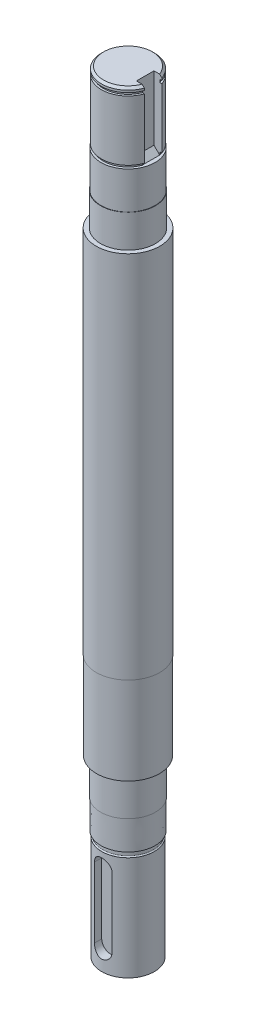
ISO-10303-21;
HEADER;
FILE_DESCRIPTION(('STEP AP214'),'2;1');
FILE_NAME('part.step','',(''),(''),'','','');
FILE_SCHEMA(('AUTOMOTIVE_DESIGN { 1 0 10303 214 1 1 1 1 }'));
ENDSEC;
DATA;
#1=APPLICATION_CONTEXT('core data for automotive mechanical design processes');
#2=APPLICATION_PROTOCOL_DEFINITION('international standard','automotive_design',2000,#1);
#3=PRODUCT_CONTEXT('',#1,'mechanical');
#4=PRODUCT('Part','Part','',(#3));
#5=PRODUCT_RELATED_PRODUCT_CATEGORY('part','',(#4));
#6=PRODUCT_DEFINITION_FORMATION('','',#4);
#7=PRODUCT_DEFINITION_CONTEXT('part definition',#1,'design');
#8=PRODUCT_DEFINITION('design','',#6,#7);
#9=PRODUCT_DEFINITION_SHAPE('','',#8);
#10=(LENGTH_UNIT() NAMED_UNIT(*) SI_UNIT(.MILLI.,.METRE.));
#11=(NAMED_UNIT(*) PLANE_ANGLE_UNIT() SI_UNIT($,.RADIAN.));
#12=(NAMED_UNIT(*) SI_UNIT($,.STERADIAN.) SOLID_ANGLE_UNIT());
#13=UNCERTAINTY_MEASURE_WITH_UNIT(LENGTH_MEASURE(1.E-05),#10,'distance_accuracy_value','');
#14=(GEOMETRIC_REPRESENTATION_CONTEXT(3) GLOBAL_UNCERTAINTY_ASSIGNED_CONTEXT((#13)) GLOBAL_UNIT_ASSIGNED_CONTEXT((#10,
#11,#12)) REPRESENTATION_CONTEXT('',''));
#15=CARTESIAN_POINT('',(0.,0.,0.));
#16=DIRECTION('',(0.,0.,1.));
#17=DIRECTION('',(1.,0.,0.));
#18=AXIS2_PLACEMENT_3D('',#15,#16,#17);
#19=CARTESIAN_POINT('',(12.,50.,0.));
#20=DIRECTION('',(0.,-1.,0.));
#21=DIRECTION('',(0.,0.,-1.));
#22=AXIS2_PLACEMENT_3D('',#19,#20,#21);
#23=PLANE('',#22);
#24=CARTESIAN_POINT('',(0.,50.,0.));
#25=DIRECTION('',(0.,-1.,0.));
#26=DIRECTION('',(0.,0.,-1.));
#27=AXIS2_PLACEMENT_3D('',#24,#25,#26);
#28=CIRCLE('',#27,12.35);
#29=CARTESIAN_POINT('',(0.,50.,-12.35));
#30=VERTEX_POINT('',#29);
#31=EDGE_CURVE('E295',#30,#30,#28,.T.);
#32=ORIENTED_EDGE('',*,*,#31,.T.);
#33=EDGE_LOOP('',(#32));
#34=FACE_BOUND('',#33,.T.);
#35=CARTESIAN_POINT('',(0.,50.,0.));
#36=DIRECTION('',(0.,-1.,0.));
#37=DIRECTION('',(0.,0.,-1.));
#38=AXIS2_PLACEMENT_3D('',#35,#36,#37);
#39=CIRCLE('',#38,11.99);
#40=CARTESIAN_POINT('',(0.,50.,-11.99));
#41=VERTEX_POINT('',#40);
#42=EDGE_CURVE('E219',#41,#41,#39,.T.);
#43=ORIENTED_EDGE('',*,*,#42,.F.);
#44=EDGE_LOOP('',(#43));
#45=FACE_BOUND('',#44,.T.);
#46=ADVANCED_FACE('F33',(#34,#45),#23,.T.);
#47=CARTESIAN_POINT('',(0.,50.,0.));
#48=DIRECTION('',(0.,-1.,0.));
#49=DIRECTION('',(0.,0.,-1.));
#50=AXIS2_PLACEMENT_3D('',#47,#48,#49);
#51=CONICAL_SURFACE('',#50,12.35,0.000548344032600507);
#52=CARTESIAN_POINT('',(0.,63.3,0.));
#53=DIRECTION('',(0.,-1.,0.));
#54=DIRECTION('',(0.,0.,-1.));
#55=AXIS2_PLACEMENT_3D('',#52,#53,#54);
#56=CIRCLE('',#55,12.3427070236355);
#57=CARTESIAN_POINT('',(0.,63.3,-12.3427070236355));
#58=VERTEX_POINT('',#57);
#59=EDGE_CURVE('E292',#58,#58,#56,.T.);
#60=ORIENTED_EDGE('',*,*,#59,.T.);
#61=EDGE_LOOP('',(#60));
#62=FACE_BOUND('',#61,.T.);
#63=ORIENTED_EDGE('',*,*,#31,.F.);
#64=EDGE_LOOP('',(#63));
#65=FACE_BOUND('',#64,.T.);
#66=ADVANCED_FACE('F376',(#62,#65),#51,.T.);
#67=CARTESIAN_POINT('',(12.5,63.3,0.));
#68=DIRECTION('',(0.,-1.,0.));
#69=DIRECTION('',(0.,0.,-1.));
#70=AXIS2_PLACEMENT_3D('',#67,#68,#69);
#71=PLANE('',#70);
#72=CARTESIAN_POINT('',(0.,63.3,0.));
#73=DIRECTION('',(0.,-1.,0.));
#74=DIRECTION('',(0.,0.,-1.));
#75=AXIS2_PLACEMENT_3D('',#72,#73,#74);
#76=CIRCLE('',#75,12.5);
#77=CARTESIAN_POINT('',(0.,63.3,-12.5));
#78=VERTEX_POINT('',#77);
#79=EDGE_CURVE('E289',#78,#78,#76,.T.);
#80=ORIENTED_EDGE('',*,*,#79,.T.);
#81=EDGE_LOOP('',(#80));
#82=FACE_BOUND('',#81,.T.);
#83=ORIENTED_EDGE('',*,*,#59,.F.);
#84=EDGE_LOOP('',(#83));
#85=FACE_BOUND('',#84,.T.);
#86=ADVANCED_FACE('F381',(#82,#85),#71,.T.);
#87=CARTESIAN_POINT('',(0.,326.056951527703,0.));
#88=DIRECTION('',(0.,-1.,0.));
#89=DIRECTION('',(0.,0.,-1.));
#90=AXIS2_PLACEMENT_3D('',#87,#88,#89);
#91=CYLINDRICAL_SURFACE('',#90,12.5);
#92=CARTESIAN_POINT('',(0.,79.5,0.));
#93=DIRECTION('',(0.,-1.,0.));
#94=DIRECTION('',(0.,0.,-1.));
#95=AXIS2_PLACEMENT_3D('',#92,#93,#94);
#96=CIRCLE('',#95,12.5);
#97=CARTESIAN_POINT('',(0.,79.5,-12.5));
#98=VERTEX_POINT('',#97);
#99=EDGE_CURVE('E286',#98,#98,#96,.T.);
#100=ORIENTED_EDGE('',*,*,#99,.T.);
#101=EDGE_LOOP('',(#100));
#102=FACE_BOUND('',#101,.T.);
#103=ORIENTED_EDGE('',*,*,#79,.F.);
#104=EDGE_LOOP('',(#103));
#105=FACE_BOUND('',#104,.T.);
#106=ADVANCED_FACE('F388',(#102,#105),#91,.T.);
#107=CARTESIAN_POINT('',(12.5,79.5,0.));
#108=DIRECTION('',(0.,-1.,0.));
#109=DIRECTION('',(0.,0.,-1.));
#110=AXIS2_PLACEMENT_3D('',#107,#108,#109);
#111=PLANE('',#110);
#112=CARTESIAN_POINT('',(0.,79.5,0.));
#113=DIRECTION('',(0.,-1.,0.));
#114=DIRECTION('',(0.,0.,-1.));
#115=AXIS2_PLACEMENT_3D('',#112,#113,#114);
#116=CIRCLE('',#115,14.4);
#117=CARTESIAN_POINT('',(0.,79.5,-14.4));
#118=VERTEX_POINT('',#117);
#119=EDGE_CURVE('E283',#118,#118,#116,.T.);
#120=ORIENTED_EDGE('',*,*,#119,.T.);
#121=EDGE_LOOP('',(#120));
#122=FACE_BOUND('',#121,.T.);
#123=ORIENTED_EDGE('',*,*,#99,.F.);
#124=EDGE_LOOP('',(#123));
#125=FACE_BOUND('',#124,.T.);
#126=ADVANCED_FACE('F392',(#122,#125),#111,.T.);
#127=CARTESIAN_POINT('',(0.,326.056951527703,0.));
#128=DIRECTION('',(0.,-1.,0.));
#129=DIRECTION('',(0.,0.,-1.));
#130=AXIS2_PLACEMENT_3D('',#127,#128,#129);
#131=CYLINDRICAL_SURFACE('',#130,14.4);
#132=CARTESIAN_POINT('',(0.,119.5,0.));
#133=DIRECTION('',(0.,-1.,0.));
#134=DIRECTION('',(0.,0.,-1.));
#135=AXIS2_PLACEMENT_3D('',#132,#133,#134);
#136=CIRCLE('',#135,14.4);
#137=CARTESIAN_POINT('',(0.,119.5,-14.4));
#138=VERTEX_POINT('',#137);
#139=EDGE_CURVE('E280',#138,#138,#136,.T.);
#140=ORIENTED_EDGE('',*,*,#139,.T.);
#141=EDGE_LOOP('',(#140));
#142=FACE_BOUND('',#141,.T.);
#143=ORIENTED_EDGE('',*,*,#119,.F.);
#144=EDGE_LOOP('',(#143));
#145=FACE_BOUND('',#144,.T.);
#146=ADVANCED_FACE('F396',(#142,#145),#131,.T.);
#147=CARTESIAN_POINT('',(14.5,119.5,0.));
#148=DIRECTION('',(0.,-1.,0.));
#149=DIRECTION('',(0.,0.,-1.));
#150=AXIS2_PLACEMENT_3D('',#147,#148,#149);
#151=PLANE('',#150);
#152=CARTESIAN_POINT('',(0.,119.5,0.));
#153=DIRECTION('',(0.,-1.,0.));
#154=DIRECTION('',(0.,0.,-1.));
#155=AXIS2_PLACEMENT_3D('',#152,#153,#154);
#156=CIRCLE('',#155,14.5);
#157=CARTESIAN_POINT('',(0.,119.5,-14.5));
#158=VERTEX_POINT('',#157);
#159=EDGE_CURVE('E277',#158,#158,#156,.T.);
#160=ORIENTED_EDGE('',*,*,#159,.T.);
#161=EDGE_LOOP('',(#160));
#162=FACE_BOUND('',#161,.T.);
#163=ORIENTED_EDGE('',*,*,#139,.F.);
#164=EDGE_LOOP('',(#163));
#165=FACE_BOUND('',#164,.T.);
#166=ADVANCED_FACE('F400',(#162,#165),#151,.T.);
#167=CARTESIAN_POINT('',(0.,326.056951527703,0.));
#168=DIRECTION('',(0.,-1.,0.));
#169=DIRECTION('',(0.,0.,-1.));
#170=AXIS2_PLACEMENT_3D('',#167,#168,#169);
#171=CYLINDRICAL_SURFACE('',#170,14.5);
#172=CARTESIAN_POINT('',(0.,288.,0.));
#173=DIRECTION('',(0.,-1.,0.));
#174=DIRECTION('',(0.,0.,-1.));
#175=AXIS2_PLACEMENT_3D('',#172,#173,#174);
#176=CIRCLE('',#175,14.5000000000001);
#177=CARTESIAN_POINT('',(0.,288.,-14.5000000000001));
#178=VERTEX_POINT('',#177);
#179=EDGE_CURVE('E274',#178,#178,#176,.T.);
#180=ORIENTED_EDGE('',*,*,#179,.T.);
#181=EDGE_LOOP('',(#180));
#182=FACE_BOUND('',#181,.T.);
#183=ORIENTED_EDGE('',*,*,#159,.F.);
#184=EDGE_LOOP('',(#183));
#185=FACE_BOUND('',#184,.T.);
#186=ADVANCED_FACE('F404',(#182,#185),#171,.T.);
#187=CARTESIAN_POINT('',(14.5000000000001,288.,0.));
#188=DIRECTION('',(0.,1.,0.));
#189=DIRECTION('',(0.,0.,1.));
#190=AXIS2_PLACEMENT_3D('',#187,#188,#189);
#191=PLANE('',#190);
#192=CARTESIAN_POINT('',(0.,288.,0.));
#193=DIRECTION('',(0.,-1.,0.));
#194=DIRECTION('',(0.,0.,-1.));
#195=AXIS2_PLACEMENT_3D('',#192,#193,#194);
#196=CIRCLE('',#195,12.5);
#197=CARTESIAN_POINT('',(0.,288.,-12.5));
#198=VERTEX_POINT('',#197);
#199=EDGE_CURVE('E271',#198,#198,#196,.T.);
#200=ORIENTED_EDGE('',*,*,#199,.T.);
#201=EDGE_LOOP('',(#200));
#202=FACE_BOUND('',#201,.T.);
#203=ORIENTED_EDGE('',*,*,#179,.F.);
#204=EDGE_LOOP('',(#203));
#205=FACE_BOUND('',#204,.T.);
#206=ADVANCED_FACE('F408',(#202,#205),#191,.T.);
#207=CARTESIAN_POINT('',(0.,326.056951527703,0.));
#208=DIRECTION('',(0.,-1.,0.));
#209=DIRECTION('',(0.,0.,-1.));
#210=AXIS2_PLACEMENT_3D('',#207,#208,#209);
#211=CYLINDRICAL_SURFACE('',#210,12.5);
#212=CARTESIAN_POINT('',(0.,303.,0.));
#213=DIRECTION('',(0.,-1.,0.));
#214=DIRECTION('',(0.,0.,-1.));
#215=AXIS2_PLACEMENT_3D('',#212,#213,#214);
#216=CIRCLE('',#215,12.5);
#217=CARTESIAN_POINT('',(0.,303.,-12.5));
#218=VERTEX_POINT('',#217);
#219=EDGE_CURVE('E268',#218,#218,#216,.T.);
#220=ORIENTED_EDGE('',*,*,#219,.T.);
#221=EDGE_LOOP('',(#220));
#222=FACE_BOUND('',#221,.T.);
#223=ORIENTED_EDGE('',*,*,#199,.F.);
#224=EDGE_LOOP('',(#223));
#225=FACE_BOUND('',#224,.T.);
#226=ADVANCED_FACE('F412',(#222,#225),#211,.T.);
#227=CARTESIAN_POINT('',(12.5,303.,0.));
#228=DIRECTION('',(0.,1.,0.));
#229=DIRECTION('',(0.,0.,1.));
#230=AXIS2_PLACEMENT_3D('',#227,#228,#229);
#231=PLANE('',#230);
#232=CARTESIAN_POINT('',(0.,303.,0.));
#233=DIRECTION('',(0.,-1.,0.));
#234=DIRECTION('',(0.,0.,-1.));
#235=AXIS2_PLACEMENT_3D('',#232,#233,#234);
#236=CIRCLE('',#235,12.35);
#237=CARTESIAN_POINT('',(0.,303.,-12.35));
#238=VERTEX_POINT('',#237);
#239=EDGE_CURVE('E265',#238,#238,#236,.T.);
#240=ORIENTED_EDGE('',*,*,#239,.T.);
#241=EDGE_LOOP('',(#240));
#242=FACE_BOUND('',#241,.T.);
#243=ORIENTED_EDGE('',*,*,#219,.F.);
#244=EDGE_LOOP('',(#243));
#245=FACE_BOUND('',#244,.T.);
#246=ADVANCED_FACE('F416',(#242,#245),#231,.T.);
#247=CARTESIAN_POINT('',(0.,326.056951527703,0.));
#248=DIRECTION('',(0.,-1.,0.));
#249=DIRECTION('',(0.,0.,-1.));
#250=AXIS2_PLACEMENT_3D('',#247,#248,#249);
#251=CYLINDRICAL_SURFACE('',#250,12.35);
#252=CARTESIAN_POINT('',(0.,320.,0.));
#253=DIRECTION('',(0.,-1.,0.));
#254=DIRECTION('',(0.,0.,-1.));
#255=AXIS2_PLACEMENT_3D('',#252,#253,#254);
#256=CIRCLE('',#255,12.35);
#257=CARTESIAN_POINT('',(0.,320.,-12.35));
#258=VERTEX_POINT('',#257);
#259=EDGE_CURVE('E262',#258,#258,#256,.T.);
#260=ORIENTED_EDGE('',*,*,#259,.T.);
#261=EDGE_LOOP('',(#260));
#262=FACE_BOUND('',#261,.T.);
#263=ORIENTED_EDGE('',*,*,#239,.F.);
#264=EDGE_LOOP('',(#263));
#265=FACE_BOUND('',#264,.T.);
#266=ADVANCED_FACE('F420',(#262,#265),#251,.T.);
#267=CARTESIAN_POINT('',(12.35,320.,0.));
#268=DIRECTION('',(0.,1.,0.));
#269=DIRECTION('',(0.,0.,1.));
#270=AXIS2_PLACEMENT_3D('',#267,#268,#269);
#271=PLANE('',#270);
#272=DIRECTION('',(1.,0.,0.));
#273=VECTOR('',#272,1.);
#274=CARTESIAN_POINT('',(7.85,320.,-4.));
#275=LINE('',#274,#273);
#276=CARTESIAN_POINT('',(10.45,320.,-4.));
#277=VERTEX_POINT('',#276);
#278=CARTESIAN_POINT('',(10.5226729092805,320.,-4.));
#279=VERTEX_POINT('',#278);
#280=EDGE_CURVE('E168',#277,#279,#275,.T.);
#281=ORIENTED_EDGE('',*,*,#280,.F.);
#282=DIRECTION('',(0.,0.,1.));
#283=VECTOR('',#282,1.);
#284=CARTESIAN_POINT('',(10.45,320.,4.));
#285=LINE('',#284,#283);
#286=CARTESIAN_POINT('',(10.45,320.,4.));
#287=VERTEX_POINT('',#286);
#288=EDGE_CURVE('E41',#277,#287,#285,.T.);
#289=ORIENTED_EDGE('',*,*,#288,.T.);
#290=DIRECTION('',(1.,0.,0.));
#291=VECTOR('',#290,1.);
#292=CARTESIAN_POINT('',(7.85,320.,4.));
#293=LINE('',#292,#291);
#294=CARTESIAN_POINT('',(10.5226729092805,320.,4.));
#295=VERTEX_POINT('',#294);
#296=EDGE_CURVE('E166',#287,#295,#293,.T.);
#297=ORIENTED_EDGE('',*,*,#296,.T.);
#298=CARTESIAN_POINT('',(0.,320.,0.));
#299=DIRECTION('',(0.,-1.,0.));
#300=DIRECTION('',(0.,0.,-1.));
#301=AXIS2_PLACEMENT_3D('',#298,#299,#300);
#302=CIRCLE('',#301,11.2572929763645);
#303=EDGE_CURVE('E259',#295,#279,#302,.T.);
#304=ORIENTED_EDGE('',*,*,#303,.T.);
#305=EDGE_LOOP('',(#281,#289,#297,#304));
#306=FACE_BOUND('',#305,.T.);
#307=ORIENTED_EDGE('',*,*,#259,.F.);
#308=EDGE_LOOP('',(#307));
#309=FACE_BOUND('',#308,.T.);
#310=ADVANCED_FACE('F424',(#306,#309),#271,.T.);
#311=CARTESIAN_POINT('',(0.,326.056951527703,0.));
#312=DIRECTION('',(0.,-1.,0.));
#313=DIRECTION('',(0.,0.,-1.));
#314=AXIS2_PLACEMENT_3D('',#311,#312,#313);
#315=CYLINDRICAL_SURFACE('',#314,11.2572929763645);
#316=DIRECTION('',(0.,-1.,0.));
#317=VECTOR('',#316,1.);
#318=CARTESIAN_POINT('',(10.5226729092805,326.056951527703,-4.));
#319=LINE('',#318,#317);
#320=CARTESIAN_POINT('',(10.5226729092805,321.3,-4.));
#321=VERTEX_POINT('',#320);
#322=EDGE_CURVE('E201',#279,#321,#319,.F.);
#323=ORIENTED_EDGE('',*,*,#322,.F.);
#324=ORIENTED_EDGE('',*,*,#303,.F.);
#325=DIRECTION('',(0.,-1.,0.));
#326=VECTOR('',#325,1.);
#327=CARTESIAN_POINT('',(10.5226729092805,326.056951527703,4.));
#328=LINE('',#327,#326);
#329=CARTESIAN_POINT('',(10.5226729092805,321.3,4.));
#330=VERTEX_POINT('',#329);
#331=EDGE_CURVE('E186',#330,#295,#328,.T.);
#332=ORIENTED_EDGE('',*,*,#331,.F.);
#333=CARTESIAN_POINT('',(0.,321.3,0.));
#334=DIRECTION('',(0.,-1.,0.));
#335=DIRECTION('',(0.,0.,-1.));
#336=AXIS2_PLACEMENT_3D('',#333,#334,#335);
#337=CIRCLE('',#336,11.2572929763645);
#338=EDGE_CURVE('E256',#330,#321,#337,.T.);
#339=ORIENTED_EDGE('',*,*,#338,.T.);
#340=EDGE_LOOP('',(#323,#324,#332,#339));
#341=FACE_BOUND('',#340,.T.);
#342=ADVANCED_FACE('F428',(#341),#315,.T.);
#343=CARTESIAN_POINT('',(11.2572929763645,321.3,0.));
#344=DIRECTION('',(0.,-1.,0.));
#345=DIRECTION('',(0.,0.,-1.));
#346=AXIS2_PLACEMENT_3D('',#343,#344,#345);
#347=PLANE('',#346);
#348=DIRECTION('',(1.,0.,0.));
#349=VECTOR('',#348,1.);
#350=CARTESIAN_POINT('',(11.2572929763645,321.3,-4.));
#351=LINE('',#350,#349);
#352=CARTESIAN_POINT('',(11.472684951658,321.3,-4.));
#353=VERTEX_POINT('',#352);
#354=EDGE_CURVE('E199',#321,#353,#351,.T.);
#355=ORIENTED_EDGE('',*,*,#354,.F.);
#356=ORIENTED_EDGE('',*,*,#338,.F.);
#357=DIRECTION('',(-1.,0.,0.));
#358=VECTOR('',#357,1.);
#359=CARTESIAN_POINT('',(11.2572929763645,321.3,4.));
#360=LINE('',#359,#358);
#361=CARTESIAN_POINT('',(11.472684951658,321.3,4.));
#362=VERTEX_POINT('',#361);
#363=EDGE_CURVE('E184',#362,#330,#360,.T.);
#364=ORIENTED_EDGE('',*,*,#363,.F.);
#365=CARTESIAN_POINT('',(0.,321.3,0.));
#366=DIRECTION('',(0.,-1.,0.));
#367=DIRECTION('',(0.,0.,-1.));
#368=AXIS2_PLACEMENT_3D('',#365,#366,#367);
#369=CIRCLE('',#368,12.15);
#370=EDGE_CURVE('E253',#362,#353,#369,.T.);
#371=ORIENTED_EDGE('',*,*,#370,.T.);
#372=EDGE_LOOP('',(#355,#356,#364,#371));
#373=FACE_BOUND('',#372,.T.);
#374=ADVANCED_FACE('F431',(#373),#347,.T.);
#375=CARTESIAN_POINT('',(0.,326.056951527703,0.));
#376=DIRECTION('',(0.,-1.,0.));
#377=DIRECTION('',(0.,0.,-1.));
#378=AXIS2_PLACEMENT_3D('',#375,#376,#377);
#379=CYLINDRICAL_SURFACE('',#378,12.15);
#380=DIRECTION('',(0.,-1.,0.));
#381=VECTOR('',#380,1.);
#382=CARTESIAN_POINT('',(11.472684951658,326.056951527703,-4.));
#383=LINE('',#382,#381);
#384=CARTESIAN_POINT('',(11.472684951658,348.7,-4.));
#385=VERTEX_POINT('',#384);
#386=EDGE_CURVE('E197',#353,#385,#383,.F.);
#387=ORIENTED_EDGE('',*,*,#386,.F.);
#388=ORIENTED_EDGE('',*,*,#370,.F.);
#389=DIRECTION('',(0.,-1.,0.));
#390=VECTOR('',#389,1.);
#391=CARTESIAN_POINT('',(11.472684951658,326.056951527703,4.));
#392=LINE('',#391,#390);
#393=CARTESIAN_POINT('',(11.472684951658,348.7,4.));
#394=VERTEX_POINT('',#393);
#395=EDGE_CURVE('E182',#394,#362,#392,.T.);
#396=ORIENTED_EDGE('',*,*,#395,.F.);
#397=CARTESIAN_POINT('',(0.,348.7,0.));
#398=DIRECTION('',(0.,-1.,0.));
#399=DIRECTION('',(0.,0.,-1.));
#400=AXIS2_PLACEMENT_3D('',#397,#398,#399);
#401=CIRCLE('',#400,12.15);
#402=EDGE_CURVE('E250',#394,#385,#401,.T.);
#403=ORIENTED_EDGE('',*,*,#402,.T.);
#404=EDGE_LOOP('',(#387,#388,#396,#403));
#405=FACE_BOUND('',#404,.T.);
#406=ADVANCED_FACE('F435',(#405),#379,.T.);
#407=CARTESIAN_POINT('',(11.2499999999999,348.7,0.));
#408=DIRECTION('',(0.,1.,0.));
#409=DIRECTION('',(0.,0.,1.));
#410=AXIS2_PLACEMENT_3D('',#407,#408,#409);
#411=PLANE('',#410);
#412=DIRECTION('',(-1.,0.,0.));
#413=VECTOR('',#412,1.);
#414=CARTESIAN_POINT('',(11.2499999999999,348.7,-4.));
#415=LINE('',#414,#413);
#416=CARTESIAN_POINT('',(10.5148704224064,348.7,-4.));
#417=VERTEX_POINT('',#416);
#418=EDGE_CURVE('E195',#385,#417,#415,.T.);
#419=ORIENTED_EDGE('',*,*,#418,.F.);
#420=ORIENTED_EDGE('',*,*,#402,.F.);
#421=DIRECTION('',(1.,0.,0.));
#422=VECTOR('',#421,1.);
#423=CARTESIAN_POINT('',(11.2499999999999,348.7,4.));
#424=LINE('',#423,#422);
#425=CARTESIAN_POINT('',(10.5148704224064,348.7,4.));
#426=VERTEX_POINT('',#425);
#427=EDGE_CURVE('E180',#426,#394,#424,.T.);
#428=ORIENTED_EDGE('',*,*,#427,.F.);
#429=CARTESIAN_POINT('',(0.,348.7,0.));
#430=DIRECTION('',(0.,-1.,0.));
#431=DIRECTION('',(0.,0.,-1.));
#432=AXIS2_PLACEMENT_3D('',#429,#430,#431);
#433=CIRCLE('',#432,11.2499999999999);
#434=EDGE_CURVE('E247',#426,#417,#433,.T.);
#435=ORIENTED_EDGE('',*,*,#434,.T.);
#436=EDGE_LOOP('',(#419,#420,#428,#435));
#437=FACE_BOUND('',#436,.T.);
#438=ADVANCED_FACE('F439',(#437),#411,.T.);
#439=CARTESIAN_POINT('',(0.,326.056951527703,0.));
#440=DIRECTION('',(0.,-1.,0.));
#441=DIRECTION('',(0.,0.,-1.));
#442=AXIS2_PLACEMENT_3D('',#439,#440,#441);
#443=CYLINDRICAL_SURFACE('',#442,11.2499999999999);
#444=DIRECTION('',(0.,-1.,0.));
#445=VECTOR('',#444,1.);
#446=CARTESIAN_POINT('',(10.5148704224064,326.056951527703,-4.));
#447=LINE('',#446,#445);
#448=CARTESIAN_POINT('',(10.5148704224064,350.,-4.));
#449=VERTEX_POINT('',#448);
#450=EDGE_CURVE('E193',#417,#449,#447,.F.);
#451=ORIENTED_EDGE('',*,*,#450,.F.);
#452=ORIENTED_EDGE('',*,*,#434,.F.);
#453=DIRECTION('',(0.,-1.,0.));
#454=VECTOR('',#453,1.);
#455=CARTESIAN_POINT('',(10.5148704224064,326.056951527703,4.));
#456=LINE('',#455,#454);
#457=CARTESIAN_POINT('',(10.5148704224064,350.,4.));
#458=VERTEX_POINT('',#457);
#459=EDGE_CURVE('E178',#458,#426,#456,.T.);
#460=ORIENTED_EDGE('',*,*,#459,.F.);
#461=CARTESIAN_POINT('',(0.,350.,0.));
#462=DIRECTION('',(0.,-1.,0.));
#463=DIRECTION('',(0.,0.,-1.));
#464=AXIS2_PLACEMENT_3D('',#461,#462,#463);
#465=CIRCLE('',#464,11.2499999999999);
#466=EDGE_CURVE('E244',#458,#449,#465,.T.);
#467=ORIENTED_EDGE('',*,*,#466,.T.);
#468=EDGE_LOOP('',(#451,#452,#460,#467));
#469=FACE_BOUND('',#468,.T.);
#470=ADVANCED_FACE('F443',(#469),#443,.T.);
#471=CARTESIAN_POINT('',(12.1499999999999,350.,0.));
#472=DIRECTION('',(0.,-1.,0.));
#473=DIRECTION('',(0.,0.,-1.));
#474=AXIS2_PLACEMENT_3D('',#471,#472,#473);
#475=PLANE('',#474);
#476=DIRECTION('',(1.,0.,0.));
#477=VECTOR('',#476,1.);
#478=CARTESIAN_POINT('',(12.1499999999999,350.,-4.));
#479=LINE('',#478,#477);
#480=CARTESIAN_POINT('',(11.472684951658,350.,-4.));
#481=VERTEX_POINT('',#480);
#482=EDGE_CURVE('E191',#449,#481,#479,.T.);
#483=ORIENTED_EDGE('',*,*,#482,.F.);
#484=ORIENTED_EDGE('',*,*,#466,.F.);
#485=DIRECTION('',(-1.,0.,0.));
#486=VECTOR('',#485,1.);
#487=CARTESIAN_POINT('',(12.1499999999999,350.,4.));
#488=LINE('',#487,#486);
#489=CARTESIAN_POINT('',(11.472684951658,350.,4.));
#490=VERTEX_POINT('',#489);
#491=EDGE_CURVE('E175',#490,#458,#488,.T.);
#492=ORIENTED_EDGE('',*,*,#491,.F.);
#493=CARTESIAN_POINT('',(0.,350.,0.));
#494=DIRECTION('',(0.,-1.,0.));
#495=DIRECTION('',(0.,0.,-1.));
#496=AXIS2_PLACEMENT_3D('',#493,#494,#495);
#497=CIRCLE('',#496,12.1499999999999);
#498=EDGE_CURVE('E241',#490,#481,#497,.T.);
#499=ORIENTED_EDGE('',*,*,#498,.T.);
#500=EDGE_LOOP('',(#483,#484,#492,#499));
#501=FACE_BOUND('',#500,.T.);
#502=ADVANCED_FACE('F447',(#501),#475,.T.);
#503=CARTESIAN_POINT('',(0.,326.056951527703,0.));
#504=DIRECTION('',(0.,-1.,0.));
#505=DIRECTION('',(0.,0.,-1.));
#506=AXIS2_PLACEMENT_3D('',#503,#504,#505);
#507=CYLINDRICAL_SURFACE('',#506,12.15);
#508=DIRECTION('',(0.,-1.,0.));
#509=VECTOR('',#508,1.);
#510=CARTESIAN_POINT('',(11.472684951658,326.056951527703,-4.));
#511=LINE('',#510,#509);
#512=CARTESIAN_POINT('',(11.472684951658,351.,-4.));
#513=VERTEX_POINT('',#512);
#514=EDGE_CURVE('E189',#481,#513,#511,.F.);
#515=ORIENTED_EDGE('',*,*,#514,.F.);
#516=ORIENTED_EDGE('',*,*,#498,.F.);
#517=DIRECTION('',(0.,-1.,0.));
#518=VECTOR('',#517,1.);
#519=CARTESIAN_POINT('',(11.472684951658,326.056951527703,4.));
#520=LINE('',#519,#518);
#521=CARTESIAN_POINT('',(11.472684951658,351.,4.));
#522=VERTEX_POINT('',#521);
#523=EDGE_CURVE('E173',#522,#490,#520,.T.);
#524=ORIENTED_EDGE('',*,*,#523,.F.);
#525=CARTESIAN_POINT('',(0.,351.,0.));
#526=DIRECTION('',(0.,1.,0.));
#527=DIRECTION('',(0.,0.,1.));
#528=AXIS2_PLACEMENT_3D('',#525,#526,#527);
#529=CIRCLE('',#528,12.15);
#530=EDGE_CURVE('E301',#522,#513,#529,.F.);
#531=ORIENTED_EDGE('',*,*,#530,.T.);
#532=EDGE_LOOP('',(#515,#516,#524,#531));
#533=FACE_BOUND('',#532,.T.);
#534=ADVANCED_FACE('F451',(#533),#507,.T.);
#535=CARTESIAN_POINT('',(12.15,352.,0.));
#536=DIRECTION('',(0.,1.,0.));
#537=DIRECTION('',(0.,0.,1.));
#538=AXIS2_PLACEMENT_3D('',#535,#536,#537);
#539=PLANE('',#538);
#540=DIRECTION('',(1.,0.,0.));
#541=VECTOR('',#540,1.);
#542=CARTESIAN_POINT('',(7.85,352.,-4.));
#543=LINE('',#542,#541);
#544=CARTESIAN_POINT('',(7.85,352.,-4.));
#545=VERTEX_POINT('',#544);
#546=CARTESIAN_POINT('',(10.4078095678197,352.,-4.));
#547=VERTEX_POINT('',#546);
#548=EDGE_CURVE('E176',#545,#547,#543,.T.);
#549=ORIENTED_EDGE('',*,*,#548,.T.);
#550=CARTESIAN_POINT('',(0.,352.,0.));
#551=DIRECTION('',(0.,1.,0.));
#552=DIRECTION('',(0.,0.,1.));
#553=AXIS2_PLACEMENT_3D('',#550,#551,#552);
#554=CIRCLE('',#553,11.1499999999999);
#555=CARTESIAN_POINT('',(10.4078095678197,352.,4.));
#556=VERTEX_POINT('',#555);
#557=EDGE_CURVE('E165',#547,#556,#554,.T.);
#558=ORIENTED_EDGE('',*,*,#557,.T.);
#559=DIRECTION('',(1.,0.,0.));
#560=VECTOR('',#559,1.);
#561=CARTESIAN_POINT('',(7.85,352.,4.));
#562=LINE('',#561,#560);
#563=CARTESIAN_POINT('',(7.85,352.,4.));
#564=VERTEX_POINT('',#563);
#565=EDGE_CURVE('E147',#564,#556,#562,.T.);
#566=ORIENTED_EDGE('',*,*,#565,.F.);
#567=DIRECTION('',(0.,0.,1.));
#568=VECTOR('',#567,1.);
#569=CARTESIAN_POINT('',(7.85,352.,4.));
#570=LINE('',#569,#568);
#571=EDGE_CURVE('E154',#545,#564,#570,.T.);
#572=ORIENTED_EDGE('',*,*,#571,.F.);
#573=EDGE_LOOP('',(#549,#558,#566,#572));
#574=FACE_BOUND('',#573,.T.);
#575=ADVANCED_FACE('F163',(#574),#539,.T.);
#576=CARTESIAN_POINT('',(0.,351.,0.));
#577=DIRECTION('',(0.,-1.,0.));
#578=DIRECTION('',(0.,0.,-1.));
#579=AXIS2_PLACEMENT_3D('',#576,#577,#578);
#580=CONICAL_SURFACE('',#579,12.15,0.785398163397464);
#581=CARTESIAN_POINT('',(16.7200622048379,345.958127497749,-4.));
#582=CARTESIAN_POINT('',(16.223932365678,346.440582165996,-4.));
#583=CARTESIAN_POINT('',(15.727275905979,346.92249878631,-4.));
#584=CARTESIAN_POINT('',(14.7324625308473,347.88471369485,-4.));
#585=CARTESIAN_POINT('',(14.2343057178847,348.365012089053,-4.));
#586=CARTESIAN_POINT('',(13.236269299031,349.32323347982,-4.));
#587=CARTESIAN_POINT('',(12.7363908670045,349.801157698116,-4.));
#588=CARTESIAN_POINT('',(11.7338109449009,350.75411902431,-4.));
#589=CARTESIAN_POINT('',(11.2311092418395,351.229155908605,-4.));
#590=CARTESIAN_POINT('',(10.4738218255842,351.938700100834,-4.));
#591=CARTESIAN_POINT('',(10.2207427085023,352.174815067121,-4.));
#592=CARTESIAN_POINT('',(9.71334660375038,352.645708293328,-4.));
#593=CARTESIAN_POINT('',(9.45902962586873,352.880486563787,-4.));
#594=CARTESIAN_POINT('',(8.94891205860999,353.34833217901,-4.));
#595=CARTESIAN_POINT('',(8.69311175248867,353.581399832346,-4.));
#596=CARTESIAN_POINT('',(8.1795805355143,354.045417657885,-4.));
#597=CARTESIAN_POINT('',(7.92184956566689,354.2763677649,-4.));
#598=CARTESIAN_POINT('',(7.40373040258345,354.735676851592,-4.));
#599=CARTESIAN_POINT('',(7.14334031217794,354.964033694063,-4.));
#600=CARTESIAN_POINT('',(6.6193763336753,355.417035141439,-4.));
#601=CARTESIAN_POINT('',(6.35580272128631,355.641680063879,-4.));
#602=CARTESIAN_POINT('',(5.95714867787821,355.974880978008,-4.));
#603=CARTESIAN_POINT('',(5.82367153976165,356.085355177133,-4.));
#604=CARTESIAN_POINT('',(5.55546367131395,356.304766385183,-4.));
#605=CARTESIAN_POINT('',(5.42073297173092,356.413703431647,-4.));
#606=CARTESIAN_POINT('',(5.14976483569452,356.629772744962,-4.));
#607=CARTESIAN_POINT('',(5.01352697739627,356.736904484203,-4.));
#608=CARTESIAN_POINT('',(4.73929378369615,356.948916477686,-4.));
#609=CARTESIAN_POINT('',(4.60129830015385,357.05379654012,-4.));
#610=CARTESIAN_POINT('',(4.46229111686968,357.15733431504,-4.));
#611=B_SPLINE_CURVE_WITH_KNOTS('',3,(#581,#582,#583,#584,#585,#586,#587,#588,#589,#590,#591,
#592,#593,#594,#595,#596,#597,#598,#599,#600,#601,#602,#603,#604,#605,#606,#607,#608,#609,#610),
.UNSPECIFIED.,.F.,.F.,(4,2,2,2,2,2,2,2,2,2,2,2,2,2,4),(0.,2.07609728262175,4.15205585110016,
6.22680399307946,8.30171081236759,9.3400683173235,10.3784176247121,11.4165747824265,
12.4547637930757,13.4937540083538,14.5326548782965,15.0524402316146,15.5722128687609,
16.0921348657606,16.6121009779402),.UNSPECIFIED.);
#612=EDGE_CURVE('E356',#513,#547,#611,.T.);
#613=ORIENTED_EDGE('',*,*,#612,.F.);
#614=ORIENTED_EDGE('',*,*,#530,.F.);
#615=CARTESIAN_POINT('',(4.46229111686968,357.15733431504,4.));
#616=CARTESIAN_POINT('',(4.58005525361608,357.069628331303,4.));
#617=CARTESIAN_POINT('',(4.69708938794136,356.980951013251,4.));
#618=CARTESIAN_POINT('',(4.92986603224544,356.801929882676,4.));
#619=CARTESIAN_POINT('',(5.04560861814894,356.711586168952,4.));
#620=CARTESIAN_POINT('',(5.27595889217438,356.529518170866,4.));
#621=CARTESIAN_POINT('',(5.39056682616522,356.437794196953,4.));
#622=CARTESIAN_POINT('',(5.61881468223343,356.253147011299,4.));
#623=CARTESIAN_POINT('',(5.73245458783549,356.160223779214,4.));
#624=CARTESIAN_POINT('',(6.07198795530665,355.880016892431,4.));
#625=CARTESIAN_POINT('',(6.29661620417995,355.691199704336,4.));
#626=CARTESIAN_POINT('',(6.7432629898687,355.310485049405,4.));
#627=CARTESIAN_POINT('',(6.96528135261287,355.118587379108,4.));
#628=CARTESIAN_POINT('',(7.4070758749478,354.732563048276,4.));
#629=CARTESIAN_POINT('',(7.6268535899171,354.538438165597,4.));
#630=CARTESIAN_POINT('',(8.06473874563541,354.148326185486,4.));
#631=CARTESIAN_POINT('',(8.28284622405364,353.952339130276,4.));
#632=CARTESIAN_POINT('',(8.717729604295,353.558845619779,4.));
#633=CARTESIAN_POINT('',(8.9345053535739,353.36133899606,4.));
#634=CARTESIAN_POINT('',(9.36693981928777,352.965106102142,4.));
#635=CARTESIAN_POINT('',(9.58259853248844,352.766379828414,4.));
#636=CARTESIAN_POINT('',(9.87539718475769,352.495300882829,4.));
#637=CARTESIAN_POINT('',(9.95294288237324,352.423385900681,4.));
#638=CARTESIAN_POINT('',(10.1079187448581,352.279434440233,4.));
#639=CARTESIAN_POINT('',(10.1853489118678,352.207397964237,4.));
#640=CARTESIAN_POINT('',(10.4174886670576,351.991105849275,4.));
#641=CARTESIAN_POINT('',(10.5720370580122,351.84667720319,4.));
#642=CARTESIAN_POINT('',(11.2313161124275,351.228960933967,4.));
#643=CARTESIAN_POINT('',(11.734224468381,350.753727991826,4.));
#644=CARTESIAN_POINT('',(12.7372584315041,349.800331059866,4.));
#645=CARTESIAN_POINT('',(13.2373840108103,349.322167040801,4.));
#646=CARTESIAN_POINT('',(14.2354612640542,348.363898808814,4.));
#647=CARTESIAN_POINT('',(14.7334135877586,347.883795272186,4.));
#648=CARTESIAN_POINT('',(15.7277734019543,346.922016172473,4.));
#649=CARTESIAN_POINT('',(16.2241809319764,346.440340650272,4.));
#650=CARTESIAN_POINT('',(16.7200622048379,345.958127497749,4.));
#651=B_SPLINE_CURVE_WITH_KNOTS('',3,(#615,#616,#617,#618,#619,#620,#621,#622,#623,#624,#625,
#626,#627,#628,#629,#630,#631,#632,#633,#634,#635,#636,#637,#638,#639,#640,#641,#642,#643,#644,
#645,#646,#647,#648,#649,#650),.UNSPECIFIED.,.F.,.F.,(4,2,2,2,2,2,2,2,2,2,2,2,2,2,2,2,2,4),(0.,
0.440494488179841,0.880962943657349,1.32133376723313,1.76171207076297,2.64200442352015,
3.52235515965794,4.40204627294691,5.28171748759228,6.16148765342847,7.04126036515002,
7.3585391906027,7.67581206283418,8.31040054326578,10.3861611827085,12.4619425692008,
14.5370537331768,16.612111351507),.UNSPECIFIED.);
#652=EDGE_CURVE('E349',#556,#522,#651,.T.);
#653=ORIENTED_EDGE('',*,*,#652,.F.);
#654=ORIENTED_EDGE('',*,*,#557,.F.);
#655=EDGE_LOOP('',(#613,#614,#653,#654));
#656=FACE_BOUND('',#655,.T.);
#657=ADVANCED_FACE('F363',(#656),#580,.T.);
#658=CARTESIAN_POINT('',(12.,47.5,0.));
#659=DIRECTION('',(0.,-1.,0.));
#660=DIRECTION('',(0.,0.,-1.));
#661=AXIS2_PLACEMENT_3D('',#658,#659,#660);
#662=PLANE('',#661);
#663=CARTESIAN_POINT('',(0.,47.5,0.));
#664=DIRECTION('',(0.,-1.,0.));
#665=DIRECTION('',(0.,0.,-1.));
#666=AXIS2_PLACEMENT_3D('',#663,#664,#665);
#667=CIRCLE('',#666,12.);
#668=CARTESIAN_POINT('',(0.,47.5,-12.));
#669=VERTEX_POINT('',#668);
#670=EDGE_CURVE('E238',#669,#669,#667,.T.);
#671=ORIENTED_EDGE('',*,*,#670,.F.);
#672=EDGE_LOOP('',(#671));
#673=FACE_BOUND('',#672,.T.);
#674=CARTESIAN_POINT('',(0.,47.5,0.));
#675=DIRECTION('',(0.,-1.,0.));
#676=DIRECTION('',(0.,0.,-1.));
#677=AXIS2_PLACEMENT_3D('',#674,#675,#676);
#678=CIRCLE('',#677,11.99);
#679=CARTESIAN_POINT('',(0.,47.5,-11.99));
#680=VERTEX_POINT('',#679);
#681=EDGE_CURVE('E235',#680,#680,#678,.T.);
#682=ORIENTED_EDGE('',*,*,#681,.T.);
#683=EDGE_LOOP('',(#682));
#684=FACE_BOUND('',#683,.T.);
#685=ADVANCED_FACE('F458',(#673,#684),#662,.F.);
#686=CARTESIAN_POINT('',(0.,47.99,0.));
#687=DIRECTION('',(0.,-1.,0.));
#688=DIRECTION('',(0.,0.,-1.));
#689=AXIS2_PLACEMENT_3D('',#686,#687,#688);
#690=TOROIDAL_SURFACE('',#689,11.99,0.489999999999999);
#691=ORIENTED_EDGE('',*,*,#681,.F.);
#692=EDGE_LOOP('',(#691));
#693=FACE_BOUND('',#692,.T.);
#694=CARTESIAN_POINT('',(0.,47.99,0.));
#695=DIRECTION('',(0.,-1.,0.));
#696=DIRECTION('',(0.,0.,-1.));
#697=AXIS2_PLACEMENT_3D('',#694,#695,#696);
#698=CIRCLE('',#697,11.5);
#699=CARTESIAN_POINT('',(0.,47.99,-11.5));
#700=VERTEX_POINT('',#699);
#701=EDGE_CURVE('E232',#700,#700,#698,.T.);
#702=ORIENTED_EDGE('',*,*,#701,.T.);
#703=EDGE_LOOP('',(#702));
#704=FACE_BOUND('',#703,.T.);
#705=ADVANCED_FACE('F461',(#693,#704),#690,.F.);
#706=CARTESIAN_POINT('',(0.,0.,0.));
#707=DIRECTION('',(0.,-1.,0.));
#708=DIRECTION('',(0.,0.,-1.));
#709=AXIS2_PLACEMENT_3D('',#706,#707,#708);
#710=CYLINDRICAL_SURFACE('',#709,11.5);
#711=ORIENTED_EDGE('',*,*,#701,.F.);
#712=EDGE_LOOP('',(#711));
#713=FACE_BOUND('',#712,.T.);
#714=CARTESIAN_POINT('',(0.,49.51,0.));
#715=DIRECTION('',(0.,-1.,0.));
#716=DIRECTION('',(0.,0.,-1.));
#717=AXIS2_PLACEMENT_3D('',#714,#715,#716);
#718=CIRCLE('',#717,11.5);
#719=CARTESIAN_POINT('',(0.,49.51,-11.5));
#720=VERTEX_POINT('',#719);
#721=EDGE_CURVE('E229',#720,#720,#718,.T.);
#722=ORIENTED_EDGE('',*,*,#721,.T.);
#723=EDGE_LOOP('',(#722));
#724=FACE_BOUND('',#723,.T.);
#725=ADVANCED_FACE('F464',(#713,#724),#710,.T.);
#726=CARTESIAN_POINT('',(0.,49.51,0.));
#727=DIRECTION('',(0.,-1.,0.));
#728=DIRECTION('',(0.,0.,-1.));
#729=AXIS2_PLACEMENT_3D('',#726,#727,#728);
#730=TOROIDAL_SURFACE('',#729,11.99,0.489999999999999);
#731=ORIENTED_EDGE('',*,*,#721,.F.);
#732=EDGE_LOOP('',(#731));
#733=FACE_BOUND('',#732,.T.);
#734=ORIENTED_EDGE('',*,*,#42,.T.);
#735=EDGE_LOOP('',(#734));
#736=FACE_BOUND('',#735,.T.);
#737=ADVANCED_FACE('F337',(#733,#736),#730,.F.);
#738=CARTESIAN_POINT('',(0.,0.,0.));
#739=DIRECTION('',(0.,-1.,0.));
#740=DIRECTION('',(0.,0.,-1.));
#741=AXIS2_PLACEMENT_3D('',#738,#739,#740);
#742=PLANE('',#741);
#743=CARTESIAN_POINT('',(0.,0.,0.));
#744=DIRECTION('',(0.,-1.,0.));
#745=DIRECTION('',(0.,0.,-1.));
#746=AXIS2_PLACEMENT_3D('',#743,#744,#745);
#747=CIRCLE('',#746,12.);
#748=CARTESIAN_POINT('',(0.,0.,-12.));
#749=VERTEX_POINT('',#748);
#750=EDGE_CURVE('E298',#749,#749,#747,.T.);
#751=ORIENTED_EDGE('',*,*,#750,.T.);
#752=EDGE_LOOP('',(#751));
#753=FACE_BOUND('',#752,.T.);
#754=ADVANCED_FACE('F471',(#753),#742,.T.);
#755=CARTESIAN_POINT('',(0.,326.056951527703,0.));
#756=DIRECTION('',(0.,-1.,0.));
#757=DIRECTION('',(0.,0.,-1.));
#758=AXIS2_PLACEMENT_3D('',#755,#756,#757);
#759=CYLINDRICAL_SURFACE('',#758,12.);
#760=CARTESIAN_POINT('',(4.,41.,11.3137084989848));
#761=CARTESIAN_POINT('',(4.0000143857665,41.1091313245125,11.3136910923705));
#762=CARTESIAN_POINT('',(3.99553419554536,41.2182529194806,11.3152871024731));
#763=CARTESIAN_POINT('',(3.97769673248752,41.4356496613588,11.3215763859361));
#764=CARTESIAN_POINT('',(3.96434185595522,41.5439250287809,11.3262688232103));
#765=CARTESIAN_POINT('',(3.92891935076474,41.7585447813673,11.3386032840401));
#766=CARTESIAN_POINT('',(3.90687756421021,41.8648939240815,11.3462365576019));
#767=CARTESIAN_POINT('',(3.85430689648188,42.0752132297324,11.364201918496));
#768=CARTESIAN_POINT('',(3.82377770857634,42.1791833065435,11.3745341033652));
#769=CARTESIAN_POINT('',(3.71986482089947,42.4863385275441,11.4091190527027));
#770=CARTESIAN_POINT('',(3.63410266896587,42.685086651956,11.4369799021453));
#771=CARTESIAN_POINT('',(3.4322845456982,43.0654028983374,11.4991525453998));
#772=CARTESIAN_POINT('',(3.31620997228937,43.246960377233,11.5334682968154));
#773=CARTESIAN_POINT('',(3.05220793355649,43.5948686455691,11.6061789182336));
#774=CARTESIAN_POINT('',(2.90330055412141,43.7604562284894,11.6446750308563));
#775=CARTESIAN_POINT('',(2.57995313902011,44.0648273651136,11.7205540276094));
#776=CARTESIAN_POINT('',(2.40550856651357,44.203606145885,11.7579367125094));
#777=CARTESIAN_POINT('',(2.03041476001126,44.4539171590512,11.8285552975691));
#778=CARTESIAN_POINT('',(1.82920040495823,44.5646436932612,11.8616574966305));
#779=CARTESIAN_POINT('',(1.40971695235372,44.7503692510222,11.9187843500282));
#780=CARTESIAN_POINT('',(1.19145308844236,44.8253791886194,11.9428117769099));
#781=CARTESIAN_POINT('',(0.752117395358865,44.9349428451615,11.9783628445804));
#782=CARTESIAN_POINT('',(0.531407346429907,44.9708130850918,11.9902923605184));
#783=CARTESIAN_POINT('',(0.0867958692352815,45.0052651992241,12.0017443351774));
#784=CARTESIAN_POINT('',(-0.137104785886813,45.0038559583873,12.0012697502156));
#785=CARTESIAN_POINT('',(-0.572415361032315,44.9646229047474,11.9882415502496));
#786=CARTESIAN_POINT('',(-0.783970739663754,44.9282295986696,11.9761624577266));
#787=CARTESIAN_POINT('',(-1.19777632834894,44.8224270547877,11.9418784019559));
#788=CARTESIAN_POINT('',(-1.4000260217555,44.7530159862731,11.9196728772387));
#789=CARTESIAN_POINT('',(-1.79261022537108,44.5823150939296,11.8670267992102));
#790=CARTESIAN_POINT('',(-1.98275302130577,44.4806179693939,11.8364817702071));
#791=CARTESIAN_POINT('',(-2.34369935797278,44.2485580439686,11.7703352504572));
#792=CARTESIAN_POINT('',(-2.51449761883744,44.1181874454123,11.7347323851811));
#793=CARTESIAN_POINT('',(-2.84038544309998,43.8253242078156,11.6602518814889));
#794=CARTESIAN_POINT('',(-2.99435951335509,43.6616098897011,11.6212989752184));
#795=CARTESIAN_POINT('',(-3.27310303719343,43.3102019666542,11.5458957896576));
#796=CARTESIAN_POINT('',(-3.39786305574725,43.1225006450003,11.5094463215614));
#797=CARTESIAN_POINT('',(-3.56109757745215,42.8252870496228,11.4595759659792));
#798=CARTESIAN_POINT('',(-3.61182358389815,42.7227445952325,11.4436484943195));
#799=CARTESIAN_POINT('',(-3.70440095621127,42.5134350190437,11.4140167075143));
#800=CARTESIAN_POINT('',(-3.74625601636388,42.4066696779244,11.4003114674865));
#801=CARTESIAN_POINT('',(-3.82067426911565,42.1897829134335,11.3755873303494));
#802=CARTESIAN_POINT('',(-3.85324757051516,42.079665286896,11.3645655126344));
#803=CARTESIAN_POINT('',(-3.90883841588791,41.8568318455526,11.3455648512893));
#804=CARTESIAN_POINT('',(-3.93186032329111,41.7441172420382,11.3375846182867));
#805=CARTESIAN_POINT('',(-3.96661962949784,41.5263575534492,11.3254693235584));
#806=CARTESIAN_POINT('',(-3.97913375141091,41.4214504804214,11.3210705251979));
#807=CARTESIAN_POINT('',(-3.99582494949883,41.2110316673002,11.3151843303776));
#808=CARTESIAN_POINT('',(-4.00001278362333,41.1055208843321,11.3136931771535));
#809=CARTESIAN_POINT('',(-4.,41.,11.3137084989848));
#810=B_SPLINE_CURVE_WITH_KNOTS('',3,(#760,#761,#762,#763,#764,#765,#766,#767,#768,#769,#770,
#771,#772,#773,#774,#775,#776,#777,#778,#779,#780,#781,#782,#783,#784,#785,#786,#787,#788,#789,
#790,#791,#792,#793,#794,#795,#796,#797,#798,#799,#800,#801,#802,#803,#804,#805,#806,#807,#808,
#809),.UNSPECIFIED.,.F.,.F.,(4,2,2,2,2,2,2,2,2,2,2,2,2,2,2,2,2,2,2,2,2,2,2,2,4),(0.,
0.327273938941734,0.654459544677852,0.980679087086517,1.30691042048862,1.95841627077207,
2.61032287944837,3.28524582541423,3.96028882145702,4.65295094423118,5.34540127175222,
6.01376445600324,6.68196834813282,7.32396236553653,7.96599198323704,8.61646637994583,
9.26711789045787,9.94834778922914,10.6297973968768,10.9759539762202,11.3219661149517,
11.6675999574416,12.0130757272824,12.3299368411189,12.6463882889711),.UNSPECIFIED.);
#811=CARTESIAN_POINT('',(4.,41.,11.3137084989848));
#812=VERTEX_POINT('',#811);
#813=CARTESIAN_POINT('',(-4.,41.,11.3137084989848));
#814=VERTEX_POINT('',#813);
#815=EDGE_CURVE('E305',#812,#814,#810,.T.);
#816=ORIENTED_EDGE('',*,*,#815,.F.);
#817=DIRECTION('',(0.,-1.,0.));
#818=VECTOR('',#817,1.);
#819=CARTESIAN_POINT('',(4.,326.056951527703,11.3137084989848));
#820=LINE('',#819,#818);
#821=CARTESIAN_POINT('',(4.,9.,11.3137084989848));
#822=VERTEX_POINT('',#821);
#823=EDGE_CURVE('E346',#822,#812,#820,.F.);
#824=ORIENTED_EDGE('',*,*,#823,.F.);
#825=CARTESIAN_POINT('',(-4.,9.,11.3137084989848));
#826=CARTESIAN_POINT('',(-4.0000143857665,8.89086867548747,11.3136910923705));
#827=CARTESIAN_POINT('',(-3.99553419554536,8.78174708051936,11.3152871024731));
#828=CARTESIAN_POINT('',(-3.97769673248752,8.5643503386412,11.3215763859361));
#829=CARTESIAN_POINT('',(-3.96434185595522,8.45607497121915,11.3262688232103));
#830=CARTESIAN_POINT('',(-3.92891935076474,8.24145521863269,11.3386032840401));
#831=CARTESIAN_POINT('',(-3.90687756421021,8.13510607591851,11.3462365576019));
#832=CARTESIAN_POINT('',(-3.85430689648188,7.92478677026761,11.364201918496));
#833=CARTESIAN_POINT('',(-3.82377770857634,7.82081669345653,11.3745341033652));
#834=CARTESIAN_POINT('',(-3.71986482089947,7.5136614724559,11.4091190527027));
#835=CARTESIAN_POINT('',(-3.63410266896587,7.31491334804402,11.4369799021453));
#836=CARTESIAN_POINT('',(-3.4322845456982,6.9345971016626,11.4991525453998));
#837=CARTESIAN_POINT('',(-3.31620997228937,6.75303962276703,11.5334682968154));
#838=CARTESIAN_POINT('',(-3.05220793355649,6.40513135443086,11.6061789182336));
#839=CARTESIAN_POINT('',(-2.90330055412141,6.23954377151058,11.6446750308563));
#840=CARTESIAN_POINT('',(-2.57995313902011,5.9351726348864,11.7205540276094));
#841=CARTESIAN_POINT('',(-2.40550856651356,5.79639385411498,11.7579367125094));
#842=CARTESIAN_POINT('',(-2.03041476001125,5.54608284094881,11.8285552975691));
#843=CARTESIAN_POINT('',(-1.82920040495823,5.43535630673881,11.8616574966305));
#844=CARTESIAN_POINT('',(-1.40971695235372,5.24963074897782,11.9187843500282));
#845=CARTESIAN_POINT('',(-1.19145308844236,5.17462081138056,11.9428117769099));
#846=CARTESIAN_POINT('',(-0.752117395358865,5.06505715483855,11.9783628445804));
#847=CARTESIAN_POINT('',(-0.531407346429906,5.02918691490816,11.9902923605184));
#848=CARTESIAN_POINT('',(-0.086795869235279,4.99473480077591,12.0017443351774));
#849=CARTESIAN_POINT('',(0.137104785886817,4.99614404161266,12.0012697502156));
#850=CARTESIAN_POINT('',(0.57241536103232,5.03537709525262,11.9882415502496));
#851=CARTESIAN_POINT('',(0.783970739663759,5.07177040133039,11.9761624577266));
#852=CARTESIAN_POINT('',(1.19777632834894,5.1775729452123,11.9418784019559));
#853=CARTESIAN_POINT('',(1.4000260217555,5.24698401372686,11.9196728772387));
#854=CARTESIAN_POINT('',(1.79261022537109,5.41768490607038,11.8670267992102));
#855=CARTESIAN_POINT('',(1.98275302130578,5.51938203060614,11.8364817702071));
#856=CARTESIAN_POINT('',(2.34369935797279,5.7514419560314,11.7703352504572));
#857=CARTESIAN_POINT('',(2.51449761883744,5.88181255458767,11.7347323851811));
#858=CARTESIAN_POINT('',(2.84038544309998,6.17467579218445,11.6602518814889));
#859=CARTESIAN_POINT('',(2.99435951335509,6.33839011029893,11.6212989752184));
#860=CARTESIAN_POINT('',(3.27310303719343,6.68979803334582,11.5458957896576));
#861=CARTESIAN_POINT('',(3.39786305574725,6.87749935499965,11.5094463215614));
#862=CARTESIAN_POINT('',(3.56109757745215,7.17471295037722,11.4595759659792));
#863=CARTESIAN_POINT('',(3.61182358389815,7.27725540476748,11.4436484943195));
#864=CARTESIAN_POINT('',(3.70440095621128,7.48656498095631,11.4140167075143));
#865=CARTESIAN_POINT('',(3.74625601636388,7.5933303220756,11.4003114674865));
#866=CARTESIAN_POINT('',(3.82067426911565,7.81021708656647,11.3755873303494));
#867=CARTESIAN_POINT('',(3.85324757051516,7.92033471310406,11.3645655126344));
#868=CARTESIAN_POINT('',(3.90883841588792,8.14316815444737,11.3455648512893));
#869=CARTESIAN_POINT('',(3.93186032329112,8.25588275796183,11.3375846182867));
#870=CARTESIAN_POINT('',(3.96661962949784,8.47364244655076,11.3254693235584));
#871=CARTESIAN_POINT('',(3.97913375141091,8.57854951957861,11.3210705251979));
#872=CARTESIAN_POINT('',(3.99582494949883,8.78896833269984,11.3151843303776));
#873=CARTESIAN_POINT('',(4.00001278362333,8.89447911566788,11.3136931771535));
#874=CARTESIAN_POINT('',(4.,9.,11.3137084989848));
#875=B_SPLINE_CURVE_WITH_KNOTS('',3,(#825,#826,#827,#828,#829,#830,#831,#832,#833,#834,#835,
#836,#837,#838,#839,#840,#841,#842,#843,#844,#845,#846,#847,#848,#849,#850,#851,#852,#853,#854,
#855,#856,#857,#858,#859,#860,#861,#862,#863,#864,#865,#866,#867,#868,#869,#870,#871,#872,#873,
#874),.UNSPECIFIED.,.F.,.F.,(4,2,2,2,2,2,2,2,2,2,2,2,2,2,2,2,2,2,2,2,2,2,2,2,4),(0.,
0.327273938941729,0.654459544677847,0.980679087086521,1.30691042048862,1.95841627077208,
2.61032287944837,3.28524582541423,3.96028882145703,4.65295094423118,5.34540127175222,
6.01376445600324,6.68196834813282,7.32396236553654,7.96599198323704,8.61646637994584,
9.26711789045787,9.94834778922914,10.6297973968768,10.9759539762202,11.3219661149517,
11.6675999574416,12.0130757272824,12.3299368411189,12.6463882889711),.UNSPECIFIED.);
#876=CARTESIAN_POINT('',(-4.,9.,11.3137084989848));
#877=VERTEX_POINT('',#876);
#878=EDGE_CURVE('E339',#877,#822,#875,.T.);
#879=ORIENTED_EDGE('',*,*,#878,.F.);
#880=DIRECTION('',(0.,-1.,0.));
#881=VECTOR('',#880,1.);
#882=CARTESIAN_POINT('',(-4.,326.056951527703,11.3137084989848));
#883=LINE('',#882,#881);
#884=EDGE_CURVE('E313',#814,#877,#883,.T.);
#885=ORIENTED_EDGE('',*,*,#884,.F.);
#886=EDGE_LOOP('',(#816,#824,#879,#885));
#887=FACE_BOUND('',#886,.T.);
#888=ORIENTED_EDGE('',*,*,#670,.T.);
#889=EDGE_LOOP('',(#888));
#890=FACE_BOUND('',#889,.T.);
#891=ORIENTED_EDGE('',*,*,#750,.F.);
#892=EDGE_LOOP('',(#891));
#893=FACE_BOUND('',#892,.T.);
#894=ADVANCED_FACE('F315',(#887,#890,#893),#759,.T.);
#895=CARTESIAN_POINT('',(0.,9.,8.));
#896=DIRECTION('',(0.,0.,1.));
#897=DIRECTION('',(1.,0.,0.));
#898=AXIS2_PLACEMENT_3D('',#895,#896,#897);
#899=CYLINDRICAL_SURFACE('',#898,4.);
#900=DIRECTION('',(0.,0.,1.));
#901=VECTOR('',#900,1.);
#902=CARTESIAN_POINT('',(-4.,9.,8.));
#903=LINE('',#902,#901);
#904=CARTESIAN_POINT('',(-4.,9.,8.));
#905=VERTEX_POINT('',#904);
#906=EDGE_CURVE('E216',#905,#877,#903,.T.);
#907=ORIENTED_EDGE('',*,*,#906,.T.);
#908=ORIENTED_EDGE('',*,*,#878,.T.);
#909=DIRECTION('',(0.,0.,1.));
#910=VECTOR('',#909,1.);
#911=CARTESIAN_POINT('',(4.,9.,8.));
#912=LINE('',#911,#910);
#913=CARTESIAN_POINT('',(4.,9.,8.));
#914=VERTEX_POINT('',#913);
#915=EDGE_CURVE('E215',#914,#822,#912,.T.);
#916=ORIENTED_EDGE('',*,*,#915,.F.);
#917=CARTESIAN_POINT('',(0.,9.,8.));
#918=DIRECTION('',(0.,0.,1.));
#919=DIRECTION('',(1.,0.,0.));
#920=AXIS2_PLACEMENT_3D('',#917,#918,#919);
#921=CIRCLE('',#920,4.);
#922=EDGE_CURVE('E203',#905,#914,#921,.T.);
#923=ORIENTED_EDGE('',*,*,#922,.F.);
#924=EDGE_LOOP('',(#907,#908,#916,#923));
#925=FACE_BOUND('',#924,.T.);
#926=ADVANCED_FACE('F332',(#925),#899,.F.);
#927=CARTESIAN_POINT('',(-4.,9.,8.));
#928=DIRECTION('',(-1.,0.,0.));
#929=DIRECTION('',(0.,0.,1.));
#930=AXIS2_PLACEMENT_3D('',#927,#928,#929);
#931=PLANE('',#930);
#932=ORIENTED_EDGE('',*,*,#884,.T.);
#933=ORIENTED_EDGE('',*,*,#906,.F.);
#934=DIRECTION('',(0.,-1.,0.));
#935=VECTOR('',#934,1.);
#936=CARTESIAN_POINT('',(-4.,9.,8.));
#937=LINE('',#936,#935);
#938=CARTESIAN_POINT('',(-4.,41.,8.));
#939=VERTEX_POINT('',#938);
#940=EDGE_CURVE('E212',#939,#905,#937,.T.);
#941=ORIENTED_EDGE('',*,*,#940,.F.);
#942=DIRECTION('',(0.,0.,1.));
#943=VECTOR('',#942,1.);
#944=CARTESIAN_POINT('',(-4.,41.,8.));
#945=LINE('',#944,#943);
#946=EDGE_CURVE('E220',#939,#814,#945,.T.);
#947=ORIENTED_EDGE('',*,*,#946,.T.);
#948=EDGE_LOOP('',(#932,#933,#941,#947));
#949=FACE_BOUND('',#948,.T.);
#950=ADVANCED_FACE('F325',(#949),#931,.F.);
#951=CARTESIAN_POINT('',(0.,41.,8.));
#952=DIRECTION('',(0.,0.,1.));
#953=DIRECTION('',(1.,0.,0.));
#954=AXIS2_PLACEMENT_3D('',#951,#952,#953);
#955=CYLINDRICAL_SURFACE('',#954,4.);
#956=DIRECTION('',(0.,0.,1.));
#957=VECTOR('',#956,1.);
#958=CARTESIAN_POINT('',(4.,41.,8.));
#959=LINE('',#958,#957);
#960=CARTESIAN_POINT('',(4.,41.,8.));
#961=VERTEX_POINT('',#960);
#962=EDGE_CURVE('E223',#961,#812,#959,.T.);
#963=ORIENTED_EDGE('',*,*,#962,.T.);
#964=ORIENTED_EDGE('',*,*,#815,.T.);
#965=ORIENTED_EDGE('',*,*,#946,.F.);
#966=CARTESIAN_POINT('',(0.,41.,8.));
#967=DIRECTION('',(0.,0.,1.));
#968=DIRECTION('',(1.,0.,0.));
#969=AXIS2_PLACEMENT_3D('',#966,#967,#968);
#970=CIRCLE('',#969,4.);
#971=EDGE_CURVE('E209',#961,#939,#970,.T.);
#972=ORIENTED_EDGE('',*,*,#971,.F.);
#973=EDGE_LOOP('',(#963,#964,#965,#972));
#974=FACE_BOUND('',#973,.T.);
#975=ADVANCED_FACE('F319',(#974),#955,.F.);
#976=CARTESIAN_POINT('',(4.,9.,8.));
#977=DIRECTION('',(1.,0.,0.));
#978=DIRECTION('',(0.,0.,-1.));
#979=AXIS2_PLACEMENT_3D('',#976,#977,#978);
#980=PLANE('',#979);
#981=ORIENTED_EDGE('',*,*,#823,.T.);
#982=ORIENTED_EDGE('',*,*,#962,.F.);
#983=DIRECTION('',(0.,1.,0.));
#984=VECTOR('',#983,1.);
#985=CARTESIAN_POINT('',(4.,9.,8.));
#986=LINE('',#985,#984);
#987=EDGE_CURVE('E206',#914,#961,#986,.T.);
#988=ORIENTED_EDGE('',*,*,#987,.F.);
#989=ORIENTED_EDGE('',*,*,#915,.T.);
#990=EDGE_LOOP('',(#981,#982,#988,#989));
#991=FACE_BOUND('',#990,.T.);
#992=ADVANCED_FACE('F324',(#991),#980,.F.);
#993=CARTESIAN_POINT('',(0.,9.,8.));
#994=DIRECTION('',(0.,0.,1.));
#995=DIRECTION('',(1.,0.,0.));
#996=AXIS2_PLACEMENT_3D('',#993,#994,#995);
#997=PLANE('',#996);
#998=ORIENTED_EDGE('',*,*,#922,.T.);
#999=ORIENTED_EDGE('',*,*,#987,.T.);
#1000=ORIENTED_EDGE('',*,*,#971,.T.);
#1001=ORIENTED_EDGE('',*,*,#940,.T.);
#1002=EDGE_LOOP('',(#998,#999,#1000,#1001));
#1003=FACE_BOUND('',#1002,.T.);
#1004=ADVANCED_FACE('F330',(#1003),#997,.T.);
#1005=CARTESIAN_POINT('',(7.85,320.,-4.));
#1006=DIRECTION('',(0.,0.,-1.));
#1007=DIRECTION('',(0.,1.,0.));
#1008=AXIS2_PLACEMENT_3D('',#1005,#1006,#1007);
#1009=PLANE('',#1008);
#1010=DIRECTION('',(0.,1.,0.));
#1011=VECTOR('',#1010,1.);
#1012=CARTESIAN_POINT('',(7.85,320.,-4.));
#1013=LINE('',#1012,#1011);
#1014=CARTESIAN_POINT('',(7.85,322.6,-4.));
#1015=VERTEX_POINT('',#1014);
#1016=EDGE_CURVE('E153',#1015,#545,#1013,.T.);
#1017=ORIENTED_EDGE('',*,*,#1016,.F.);
#1018=DIRECTION('',(-0.707106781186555,0.70710678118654,0.));
#1019=VECTOR('',#1018,1.);
#1020=CARTESIAN_POINT('',(7.85,322.6,-4.));
#1021=LINE('',#1020,#1019);
#1022=EDGE_CURVE('E55',#1015,#277,#1021,.F.);
#1023=ORIENTED_EDGE('',*,*,#1022,.T.);
#1024=ORIENTED_EDGE('',*,*,#280,.T.);
#1025=ORIENTED_EDGE('',*,*,#322,.T.);
#1026=ORIENTED_EDGE('',*,*,#354,.T.);
#1027=ORIENTED_EDGE('',*,*,#386,.T.);
#1028=ORIENTED_EDGE('',*,*,#418,.T.);
#1029=ORIENTED_EDGE('',*,*,#450,.T.);
#1030=ORIENTED_EDGE('',*,*,#482,.T.);
#1031=ORIENTED_EDGE('',*,*,#514,.T.);
#1032=ORIENTED_EDGE('',*,*,#612,.T.);
#1033=ORIENTED_EDGE('',*,*,#548,.F.);
#1034=EDGE_LOOP('',(#1017,#1023,#1024,#1025,#1026,#1027,#1028,#1029,#1030,#1031,#1032,#1033));
#1035=FACE_BOUND('',#1034,.T.);
#1036=ADVANCED_FACE('F367',(#1035),#1009,.F.);
#1037=CARTESIAN_POINT('',(7.85,320.,4.));
#1038=DIRECTION('',(0.,0.,1.));
#1039=DIRECTION('',(0.,-1.,0.));
#1040=AXIS2_PLACEMENT_3D('',#1037,#1038,#1039);
#1041=PLANE('',#1040);
#1042=ORIENTED_EDGE('',*,*,#296,.F.);
#1043=DIRECTION('',(0.707106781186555,-0.70710678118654,0.));
#1044=VECTOR('',#1043,1.);
#1045=CARTESIAN_POINT('',(7.85,322.6,4.));
#1046=LINE('',#1045,#1044);
#1047=CARTESIAN_POINT('',(7.85,322.6,4.));
#1048=VERTEX_POINT('',#1047);
#1049=EDGE_CURVE('E11',#287,#1048,#1046,.F.);
#1050=ORIENTED_EDGE('',*,*,#1049,.T.);
#1051=DIRECTION('',(0.,-1.,0.));
#1052=VECTOR('',#1051,1.);
#1053=CARTESIAN_POINT('',(7.85,320.,4.));
#1054=LINE('',#1053,#1052);
#1055=EDGE_CURVE('E143',#564,#1048,#1054,.T.);
#1056=ORIENTED_EDGE('',*,*,#1055,.F.);
#1057=ORIENTED_EDGE('',*,*,#565,.T.);
#1058=ORIENTED_EDGE('',*,*,#652,.T.);
#1059=ORIENTED_EDGE('',*,*,#523,.T.);
#1060=ORIENTED_EDGE('',*,*,#491,.T.);
#1061=ORIENTED_EDGE('',*,*,#459,.T.);
#1062=ORIENTED_EDGE('',*,*,#427,.T.);
#1063=ORIENTED_EDGE('',*,*,#395,.T.);
#1064=ORIENTED_EDGE('',*,*,#363,.T.);
#1065=ORIENTED_EDGE('',*,*,#331,.T.);
#1066=EDGE_LOOP('',(#1042,#1050,#1056,#1057,#1058,#1059,#1060,#1061,#1062,#1063,#1064,#1065));
#1067=FACE_BOUND('',#1066,.T.);
#1068=ADVANCED_FACE('F145',(#1067),#1041,.F.);
#1069=CARTESIAN_POINT('',(7.85,0.,0.));
#1070=DIRECTION('',(1.,0.,0.));
#1071=DIRECTION('',(0.,0.,-1.));
#1072=AXIS2_PLACEMENT_3D('',#1069,#1070,#1071);
#1073=PLANE('',#1072);
#1074=ORIENTED_EDGE('',*,*,#1055,.T.);
#1075=DIRECTION('',(0.,0.,-1.));
#1076=VECTOR('',#1075,1.);
#1077=CARTESIAN_POINT('',(7.85,322.6,-4.));
#1078=LINE('',#1077,#1076);
#1079=EDGE_CURVE('E622',#1048,#1015,#1078,.T.);
#1080=ORIENTED_EDGE('',*,*,#1079,.T.);
#1081=ORIENTED_EDGE('',*,*,#1016,.T.);
#1082=ORIENTED_EDGE('',*,*,#571,.T.);
#1083=EDGE_LOOP('',(#1074,#1080,#1081,#1082));
#1084=FACE_BOUND('',#1083,.T.);
#1085=ADVANCED_FACE('F157',(#1084),#1073,.T.);
#1086=CARTESIAN_POINT('',(7.85,322.6,0.));
#1087=DIRECTION('',(0.70710678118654,0.707106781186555,0.));
#1088=DIRECTION('',(0.,0.,1.));
#1089=AXIS2_PLACEMENT_3D('',#1086,#1087,#1088);
#1090=PLANE('',#1089);
#1091=ORIENTED_EDGE('',*,*,#1049,.F.);
#1092=ORIENTED_EDGE('',*,*,#288,.F.);
#1093=ORIENTED_EDGE('',*,*,#1022,.F.);
#1094=ORIENTED_EDGE('',*,*,#1079,.F.);
#1095=EDGE_LOOP('',(#1091,#1092,#1093,#1094));
#1096=FACE_BOUND('',#1095,.T.);
#1097=ADVANCED_FACE('F35',(#1096),#1090,.T.);
#1098=CLOSED_SHELL('',(#46,#66,#86,#106,#126,#146,#166,#186,#206,#226,#246,#266,#310,#342,#374,
#406,#438,#470,#502,#534,#575,#657,#685,#705,#725,#737,#754,#894,#926,#950,#975,#992,#1004,
#1036,#1068,#1085,#1097));
#1099=MANIFOLD_SOLID_BREP('B2',#1098);
#1100=ADVANCED_BREP_SHAPE_REPRESENTATION('',(#18,#1099),#14);
#1101=SHAPE_DEFINITION_REPRESENTATION(#9,#1100);
ENDSEC;
END-ISO-10303-21;
